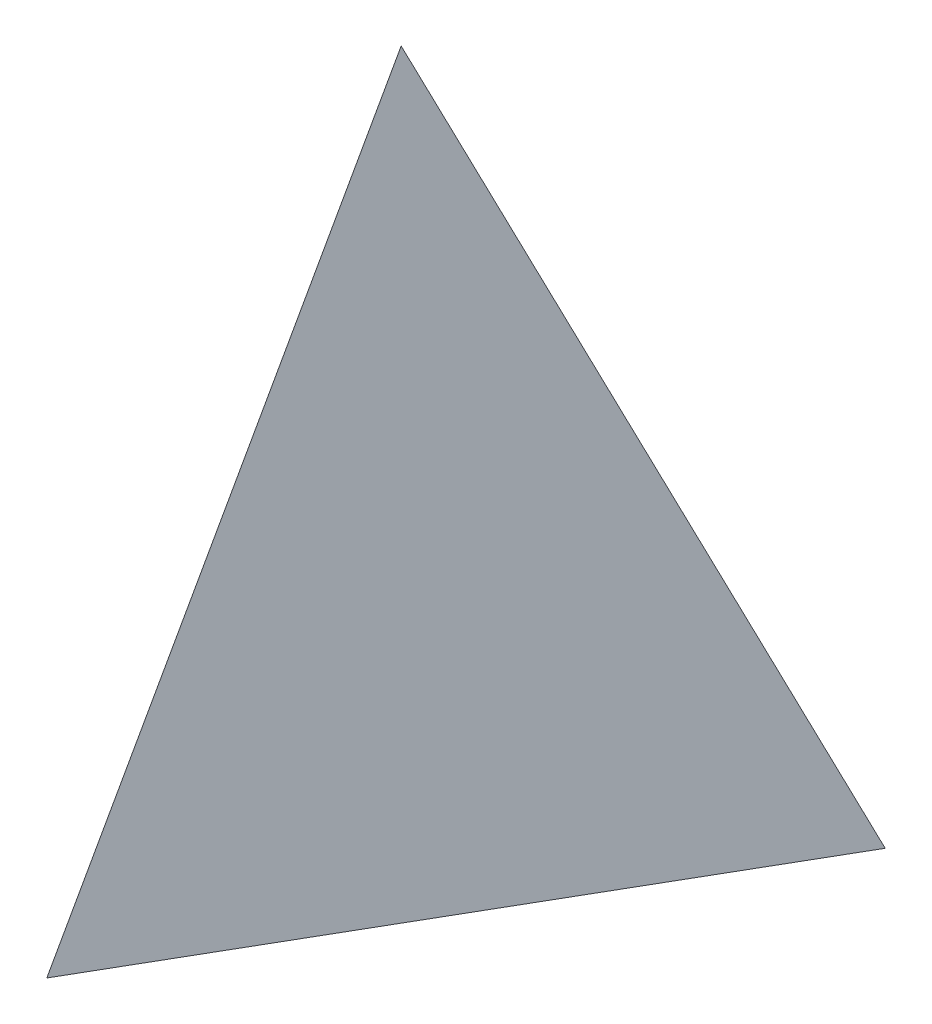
ISO-10303-21;
HEADER;
FILE_DESCRIPTION(('STEP AP214'),'2;1');
FILE_NAME('part.step','',(''),(''),'','','');
FILE_SCHEMA(('AUTOMOTIVE_DESIGN { 1 0 10303 214 1 1 1 1 }'));
ENDSEC;
DATA;
#1=APPLICATION_CONTEXT('core data for automotive mechanical design processes');
#2=APPLICATION_PROTOCOL_DEFINITION('international standard','automotive_design',2000,#1);
#3=PRODUCT_CONTEXT('',#1,'mechanical');
#4=PRODUCT('Part','Part','',(#3));
#5=PRODUCT_RELATED_PRODUCT_CATEGORY('part','',(#4));
#6=PRODUCT_DEFINITION_FORMATION('','',#4);
#7=PRODUCT_DEFINITION_CONTEXT('part definition',#1,'design');
#8=PRODUCT_DEFINITION('design','',#6,#7);
#9=PRODUCT_DEFINITION_SHAPE('','',#8);
#10=(LENGTH_UNIT() NAMED_UNIT(*) SI_UNIT(.MILLI.,.METRE.));
#11=(NAMED_UNIT(*) PLANE_ANGLE_UNIT() SI_UNIT($,.RADIAN.));
#12=(NAMED_UNIT(*) SI_UNIT($,.STERADIAN.) SOLID_ANGLE_UNIT());
#13=UNCERTAINTY_MEASURE_WITH_UNIT(LENGTH_MEASURE(1.E-05),#10,'distance_accuracy_value','');
#14=(GEOMETRIC_REPRESENTATION_CONTEXT(3) GLOBAL_UNCERTAINTY_ASSIGNED_CONTEXT((#13)) GLOBAL_UNIT_ASSIGNED_CONTEXT((#10,
#11,#12)) REPRESENTATION_CONTEXT('',''));
#15=CARTESIAN_POINT('',(0.,0.,0.));
#16=DIRECTION('',(0.,0.,1.));
#17=DIRECTION('',(1.,0.,0.));
#18=AXIS2_PLACEMENT_3D('',#15,#16,#17);
#19=CARTESIAN_POINT('',(0.,0.,45.));
#20=DIRECTION('',(0.,1.,0.));
#21=DIRECTION('',(0.,0.,1.));
#22=AXIS2_PLACEMENT_3D('',#19,#20,#21);
#23=PLANE('',#22);
#24=DIRECTION('',(0.5,0.,0.866025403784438));
#25=VECTOR('',#24,1.);
#26=CARTESIAN_POINT('',(-38.9711431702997,0.,-22.5));
#27=LINE('',#26,#25);
#28=CARTESIAN_POINT('',(-38.9711431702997,0.,-22.5));
#29=VERTEX_POINT('',#28);
#30=CARTESIAN_POINT('',(0.,0.,45.));
#31=VERTEX_POINT('',#30);
#32=EDGE_CURVE('E70',#29,#31,#27,.T.);
#33=ORIENTED_EDGE('',*,*,#32,.F.);
#34=DIRECTION('',(-1.,0.,0.));
#35=VECTOR('',#34,1.);
#36=CARTESIAN_POINT('',(38.9711431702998,0.,-22.5));
#37=LINE('',#36,#35);
#38=CARTESIAN_POINT('',(38.9711431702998,0.,-22.5));
#39=VERTEX_POINT('',#38);
#40=EDGE_CURVE('E12',#39,#29,#37,.T.);
#41=ORIENTED_EDGE('',*,*,#40,.F.);
#42=DIRECTION('',(0.5,0.,-0.866025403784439));
#43=VECTOR('',#42,1.);
#44=CARTESIAN_POINT('',(0.,0.,45.));
#45=LINE('',#44,#43);
#46=EDGE_CURVE('E49',#31,#39,#45,.T.);
#47=ORIENTED_EDGE('',*,*,#46,.F.);
#48=EDGE_LOOP('',(#33,#41,#47));
#49=FACE_BOUND('',#48,.T.);
#50=ADVANCED_FACE('F36',(#49),#23,.F.);
#51=CARTESIAN_POINT('',(0.,0.,45.));
#52=DIRECTION('',(0.83368016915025,0.270745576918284,0.48132547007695));
#53=DIRECTION('',(0.5,0.,-0.866025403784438));
#54=AXIS2_PLACEMENT_3D('',#51,#52,#53);
#55=PLANE('',#54);
#56=DIRECTION('',(0.,-0.871575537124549,0.490261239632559));
#57=VECTOR('',#56,1.);
#58=CARTESIAN_POINT('',(0.,80.,0.));
#59=LINE('',#58,#57);
#60=CARTESIAN_POINT('',(0.,80.,0.));
#61=VERTEX_POINT('',#60);
#62=EDGE_CURVE('E68',#61,#31,#59,.T.);
#63=ORIENTED_EDGE('',*,*,#62,.T.);
#64=ORIENTED_EDGE('',*,*,#46,.T.);
#65=DIRECTION('',(0.424578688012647,-0.871575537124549,-0.24513061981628));
#66=VECTOR('',#65,1.);
#67=CARTESIAN_POINT('',(0.,80.,0.));
#68=LINE('',#67,#66);
#69=EDGE_CURVE('E73',#61,#39,#68,.T.);
#70=ORIENTED_EDGE('',*,*,#69,.F.);
#71=EDGE_LOOP('',(#63,#64,#70));
#72=FACE_BOUND('',#71,.T.);
#73=ADVANCED_FACE('F76',(#72),#55,.T.);
#74=CARTESIAN_POINT('',(38.9711431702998,0.,-22.5));
#75=DIRECTION('',(0.,0.270745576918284,-0.962650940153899));
#76=DIRECTION('',(0.,0.962650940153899,0.270745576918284));
#77=AXIS2_PLACEMENT_3D('',#74,#75,#76);
#78=PLANE('',#77);
#79=ORIENTED_EDGE('',*,*,#69,.T.);
#80=ORIENTED_EDGE('',*,*,#40,.T.);
#81=DIRECTION('',(-0.424578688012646,-0.871575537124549,-0.245130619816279));
#82=VECTOR('',#81,1.);
#83=CARTESIAN_POINT('',(0.,80.,0.));
#84=LINE('',#83,#82);
#85=EDGE_CURVE('E57',#61,#29,#84,.T.);
#86=ORIENTED_EDGE('',*,*,#85,.F.);
#87=EDGE_LOOP('',(#79,#80,#86));
#88=FACE_BOUND('',#87,.T.);
#89=ADVANCED_FACE('F80',(#88),#78,.T.);
#90=CARTESIAN_POINT('',(-38.9711431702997,0.,-22.5));
#91=DIRECTION('',(-0.83368016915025,0.270745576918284,0.48132547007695));
#92=DIRECTION('',(0.5,0.,0.866025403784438));
#93=AXIS2_PLACEMENT_3D('',#90,#91,#92);
#94=PLANE('',#93);
#95=ORIENTED_EDGE('',*,*,#85,.T.);
#96=ORIENTED_EDGE('',*,*,#32,.T.);
#97=ORIENTED_EDGE('',*,*,#62,.F.);
#98=EDGE_LOOP('',(#95,#96,#97));
#99=FACE_BOUND('',#98,.T.);
#100=ADVANCED_FACE('F38',(#99),#94,.T.);
#101=CLOSED_SHELL('',(#50,#73,#89,#100));
#102=MANIFOLD_SOLID_BREP('B2',#101);
#103=ADVANCED_BREP_SHAPE_REPRESENTATION('',(#18,#102),#14);
#104=SHAPE_DEFINITION_REPRESENTATION(#9,#103);
ENDSEC;
END-ISO-10303-21;
